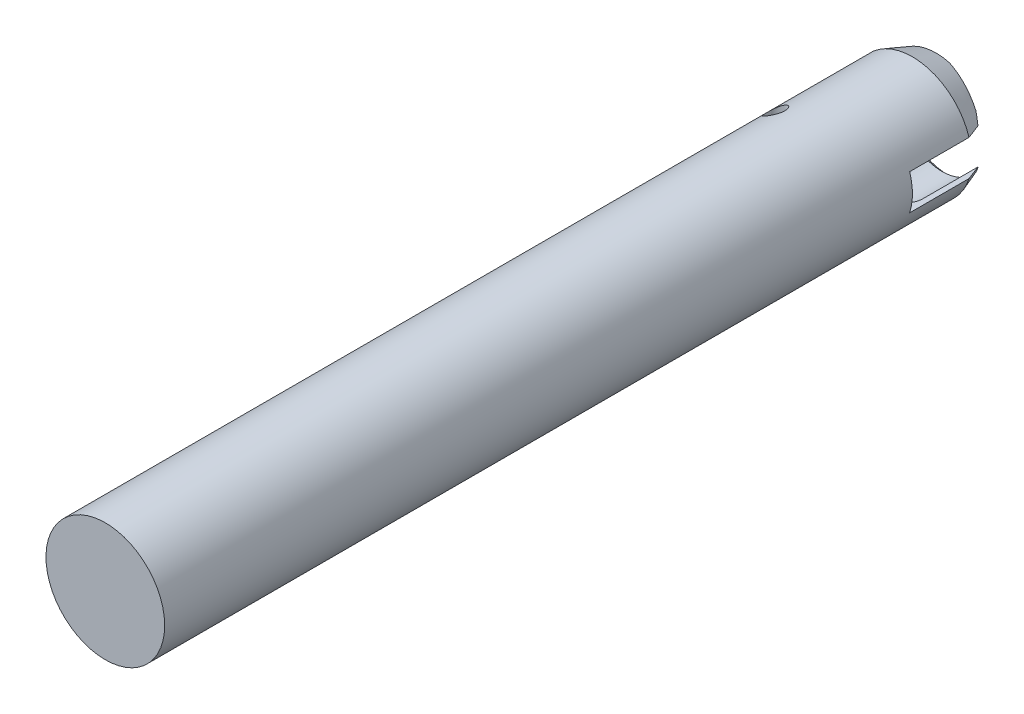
from build123d import *

# Parameters (mm, degrees)
SKETCH1_R               = 2.5
BOSS_EXTRUDE1_DEPTH     = 35
CHAMFER1_SIZE           = 1
CHAMFER1_SIZE2          = 0.363970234
SKETCH3_R               = 1.8125
CUT_EXTRUDE1_DEPTH      = 3.5
CHAMFER2_SIZE           = 0.25
SKETCH4_W               = 1.5
SKETCH4_H               = 1.1
CUT_EXTRUDE2_DEPTH      = 30
CUT_EXTRUDE3_REACH      = 37.178
SKETCH5_W               = 1.922444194
SKETCH5_H               = 1.5
CUT_EXTRUDE4_DEPTH      = 36.221477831
CUT_EXTRUDE4_DEPTH_BACK = 36.221477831
SKETCH6_R               = 0.396875
FILLET1_R               = 0.79375
SKETCH7_W               = 23.5
SKETCH7_H               = 2.1
CUT_EXTRUDE5_DEPTH      = 36.286552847
SKETCH8_W               = 23.5
SKETCH8_H               = 2.1
CUT_EXTRUDE6_DEPTH      = 2


with BuildPart() as part:
    # Sketch1 → Boss-Extrude1 (new body)
    with BuildSketch(Plane.XY):
        Circle(SKETCH1_R)
    extrude(amount=BOSS_EXTRUDE1_DEPTH)

    # Chamfer1
    chamfer1_edges = [part.edges().sort_by_distance(p)[0] for p in [
        (-2.5, 0, 0),
    ]]
    chamfer1_side = [part.faces().sort_by_distance(p)[0] for p in [
        (-2.5, 0, 17.5),
    ]]
    chamfer(chamfer1_edges, length=CHAMFER1_SIZE, length2=CHAMFER1_SIZE2, reference=chamfer1_side[0])

    # Sketch3 → Cut-Extrude1 (cut)
    with BuildSketch(Plane(origin=(0, 0, 0), x_dir=(-1, 0, 0), z_dir=(0, 0, -1))):
        with Locations((-0.5, 0)):
            Circle(SKETCH3_R)
    extrude(amount=-CUT_EXTRUDE1_DEPTH, mode=Mode.SUBTRACT)

    # Chamfer2
    chamfer2_edges = [part.edges().sort_by_distance(p)[0] for p in [
        (-0.343466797, -1.604281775, 0),
    ]]
    chamfer(chamfer2_edges, length=CHAMFER2_SIZE)

    # Sketch4 → Cut-Extrude2 (cut)
    with BuildSketch(Plane(origin=(0, 0, 0), x_dir=(-1, 0, 0), z_dir=(0, 0, -1))):
        with Locations((1.977036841, 0)):
            Rectangle(SKETCH4_W, SKETCH4_H)
    extrude(amount=-CUT_EXTRUDE2_DEPTH, mode=Mode.SUBTRACT)

    # Cut-Extrude3: up to this face of the body (flat: up to its plane)
    cut_extrude3_end = Plane(part.part.faces().sort_by_distance((0.51081307, 0, 3.5))[0])
    # Sketch5 → Cut-Extrude3 (cut, up to the picked face)
    with BuildSketch(Plane(origin=(0, 0, 0), x_dir=(-1, 0, 0), z_dir=(0, 0, -1)), mode=Mode.PRIVATE) as cut_extrude3_sk1:
        with Locations((-2.329461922, 0)):
            Rectangle(SKETCH5_W, SKETCH5_H)
    cut_extrude3_tool1 = split(extrude(cut_extrude3_sk1.sketch, amount=-CUT_EXTRUDE3_REACH, mode=Mode.PRIVATE), bisect_by=cut_extrude3_end, keep=Keep.BOTH, mode=Mode.PRIVATE)
    add(cut_extrude3_tool1.solids().sort_by(Axis((2.329462, 0, 0), (0, 0, 1)))[0], mode=Mode.SUBTRACT)

    # Sketch6 → Cut-Extrude4 (cut, two sides: drawn at the far end of the back side and taken through both)
    with BuildSketch(Plane(origin=(0, -0.55, 0), x_dir=(1, 0, 0), z_dir=(0, 1, 0)).offset(-CUT_EXTRUDE4_DEPTH_BACK)):
        with Locations(Location((-1.27, -5.5, 0), (0, 0, 270))):
            Circle(SKETCH6_R)
    extrude(amount=CUT_EXTRUDE4_DEPTH + CUT_EXTRUDE4_DEPTH_BACK, mode=Mode.SUBTRACT)

    # Fillet1
    fillet1_edges = [part.edges().sort_by_distance(p)[0] for p in [
        (0.392846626, 1.809329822, 3.5),
        (0.392846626, -1.809329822, 3.5),
    ]]
    fillet(fillet1_edges, radius=FILLET1_R)

    # Sketch7 → Cut-Extrude5 (cut, through all)
    with BuildSketch(Plane.ZY.offset(1.227036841)):
        with Locations((18.25, 0)):
            Rectangle(SKETCH7_W, SKETCH7_H)
    extrude(amount=CUT_EXTRUDE5_DEPTH, mode=Mode.SUBTRACT)

    # Sketch8 → Cut-Extrude6 (cut)
    with BuildSketch(Plane.ZY.offset(1.227036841)):
        with Locations((18.25, 0)):
            Rectangle(SKETCH8_W, SKETCH8_H)
    extrude(amount=-CUT_EXTRUDE6_DEPTH, mode=Mode.SUBTRACT)


solid = part.part
